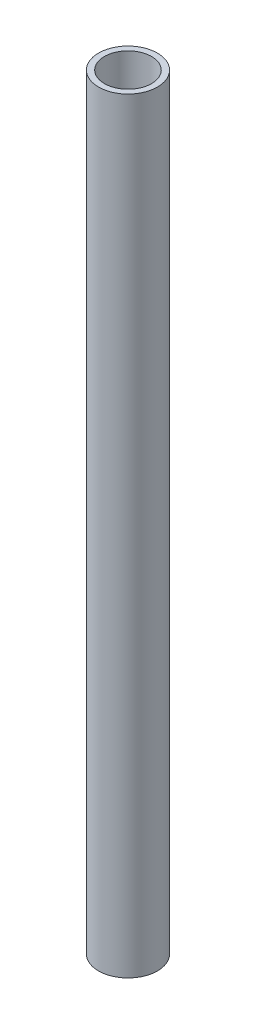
ISO-10303-21;
HEADER;
FILE_DESCRIPTION(('STEP AP214'),'2;1');
FILE_NAME('part.step','',(''),(''),'','','');
FILE_SCHEMA(('AUTOMOTIVE_DESIGN { 1 0 10303 214 1 1 1 1 }'));
ENDSEC;
DATA;
#1=APPLICATION_CONTEXT('core data for automotive mechanical design processes');
#2=APPLICATION_PROTOCOL_DEFINITION('international standard','automotive_design',2000,#1);
#3=PRODUCT_CONTEXT('',#1,'mechanical');
#4=PRODUCT('Part','Part','',(#3));
#5=PRODUCT_RELATED_PRODUCT_CATEGORY('part','',(#4));
#6=PRODUCT_DEFINITION_FORMATION('','',#4);
#7=PRODUCT_DEFINITION_CONTEXT('part definition',#1,'design');
#8=PRODUCT_DEFINITION('design','',#6,#7);
#9=PRODUCT_DEFINITION_SHAPE('','',#8);
#10=(LENGTH_UNIT() NAMED_UNIT(*) SI_UNIT(.MILLI.,.METRE.));
#11=(NAMED_UNIT(*) PLANE_ANGLE_UNIT() SI_UNIT($,.RADIAN.));
#12=(NAMED_UNIT(*) SI_UNIT($,.STERADIAN.) SOLID_ANGLE_UNIT());
#13=UNCERTAINTY_MEASURE_WITH_UNIT(LENGTH_MEASURE(1.E-05),#10,'distance_accuracy_value','');
#14=(GEOMETRIC_REPRESENTATION_CONTEXT(3) GLOBAL_UNCERTAINTY_ASSIGNED_CONTEXT((#13)) GLOBAL_UNIT_ASSIGNED_CONTEXT((#10,
#11,#12)) REPRESENTATION_CONTEXT('',''));
#15=CARTESIAN_POINT('',(0.,0.,0.));
#16=DIRECTION('',(0.,0.,1.));
#17=DIRECTION('',(1.,0.,0.));
#18=AXIS2_PLACEMENT_3D('',#15,#16,#17);
#19=CARTESIAN_POINT('',(0.,260.,0.));
#20=DIRECTION('',(0.,1.,0.));
#21=DIRECTION('',(0.,0.,1.));
#22=AXIS2_PLACEMENT_3D('',#19,#20,#21);
#23=PLANE('',#22);
#24=CARTESIAN_POINT('',(0.,260.,0.));
#25=DIRECTION('',(0.,1.,0.));
#26=DIRECTION('',(0.,0.,1.));
#27=AXIS2_PLACEMENT_3D('',#24,#25,#26);
#28=CIRCLE('',#27,10.);
#29=CARTESIAN_POINT('',(0.,260.,10.));
#30=VERTEX_POINT('',#29);
#31=EDGE_CURVE('E10',#30,#30,#28,.T.);
#32=ORIENTED_EDGE('',*,*,#31,.T.);
#33=EDGE_LOOP('',(#32));
#34=FACE_BOUND('',#33,.T.);
#35=CARTESIAN_POINT('',(0.,260.,0.));
#36=DIRECTION('',(0.,1.,0.));
#37=DIRECTION('',(0.,0.,1.));
#38=AXIS2_PLACEMENT_3D('',#35,#36,#37);
#39=CIRCLE('',#38,8.);
#40=CARTESIAN_POINT('',(0.,260.,8.));
#41=VERTEX_POINT('',#40);
#42=EDGE_CURVE('E46',#41,#41,#39,.T.);
#43=ORIENTED_EDGE('',*,*,#42,.F.);
#44=EDGE_LOOP('',(#43));
#45=FACE_BOUND('',#44,.T.);
#46=ADVANCED_FACE('F35',(#34,#45),#23,.T.);
#47=CARTESIAN_POINT('',(0.,0.,0.));
#48=DIRECTION('',(0.,1.,0.));
#49=DIRECTION('',(0.,0.,1.));
#50=AXIS2_PLACEMENT_3D('',#47,#48,#49);
#51=PLANE('',#50);
#52=CARTESIAN_POINT('',(0.,0.,0.));
#53=DIRECTION('',(0.,1.,0.));
#54=DIRECTION('',(0.,0.,1.));
#55=AXIS2_PLACEMENT_3D('',#52,#53,#54);
#56=CIRCLE('',#55,10.);
#57=CARTESIAN_POINT('',(0.,0.,10.));
#58=VERTEX_POINT('',#57);
#59=EDGE_CURVE('E39',#58,#58,#56,.T.);
#60=ORIENTED_EDGE('',*,*,#59,.F.);
#61=EDGE_LOOP('',(#60));
#62=FACE_BOUND('',#61,.T.);
#63=CARTESIAN_POINT('',(0.,0.,0.));
#64=DIRECTION('',(0.,1.,0.));
#65=DIRECTION('',(0.,0.,1.));
#66=AXIS2_PLACEMENT_3D('',#63,#64,#65);
#67=CIRCLE('',#66,8.);
#68=CARTESIAN_POINT('',(0.,0.,8.));
#69=VERTEX_POINT('',#68);
#70=EDGE_CURVE('E48',#69,#69,#67,.T.);
#71=ORIENTED_EDGE('',*,*,#70,.T.);
#72=EDGE_LOOP('',(#71));
#73=FACE_BOUND('',#72,.T.);
#74=ADVANCED_FACE('F58',(#62,#73),#51,.F.);
#75=CARTESIAN_POINT('',(0.,260.,0.));
#76=DIRECTION('',(0.,-1.,0.));
#77=DIRECTION('',(0.,0.,-1.));
#78=AXIS2_PLACEMENT_3D('',#75,#76,#77);
#79=CYLINDRICAL_SURFACE('',#78,10.);
#80=ORIENTED_EDGE('',*,*,#31,.F.);
#81=EDGE_LOOP('',(#80));
#82=FACE_BOUND('',#81,.T.);
#83=ORIENTED_EDGE('',*,*,#59,.T.);
#84=EDGE_LOOP('',(#83));
#85=FACE_BOUND('',#84,.T.);
#86=ADVANCED_FACE('F37',(#82,#85),#79,.T.);
#87=CARTESIAN_POINT('',(0.,260.,0.));
#88=DIRECTION('',(0.,-1.,0.));
#89=DIRECTION('',(0.,0.,-1.));
#90=AXIS2_PLACEMENT_3D('',#87,#88,#89);
#91=CYLINDRICAL_SURFACE('',#90,8.);
#92=ORIENTED_EDGE('',*,*,#42,.T.);
#93=EDGE_LOOP('',(#92));
#94=FACE_BOUND('',#93,.T.);
#95=ORIENTED_EDGE('',*,*,#70,.F.);
#96=EDGE_LOOP('',(#95));
#97=FACE_BOUND('',#96,.T.);
#98=ADVANCED_FACE('F54',(#94,#97),#91,.F.);
#99=CLOSED_SHELL('',(#46,#74,#86,#98));
#100=MANIFOLD_SOLID_BREP('B2',#99);
#101=ADVANCED_BREP_SHAPE_REPRESENTATION('',(#18,#100),#14);
#102=SHAPE_DEFINITION_REPRESENTATION(#9,#101);
ENDSEC;
END-ISO-10303-21;
